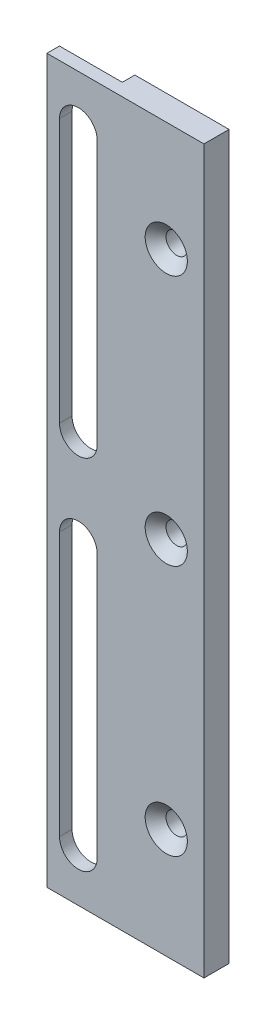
ISO-10303-21;
HEADER;
FILE_DESCRIPTION(('STEP AP214'),'2;1');
FILE_NAME('part.step','',(''),(''),'','','');
FILE_SCHEMA(('AUTOMOTIVE_DESIGN { 1 0 10303 214 1 1 1 1 }'));
ENDSEC;
DATA;
#1=APPLICATION_CONTEXT('core data for automotive mechanical design processes');
#2=APPLICATION_PROTOCOL_DEFINITION('international standard','automotive_design',2000,#1);
#3=PRODUCT_CONTEXT('',#1,'mechanical');
#4=PRODUCT('Part','Part','',(#3));
#5=PRODUCT_RELATED_PRODUCT_CATEGORY('part','',(#4));
#6=PRODUCT_DEFINITION_FORMATION('','',#4);
#7=PRODUCT_DEFINITION_CONTEXT('part definition',#1,'design');
#8=PRODUCT_DEFINITION('design','',#6,#7);
#9=PRODUCT_DEFINITION_SHAPE('','',#8);
#10=(LENGTH_UNIT() NAMED_UNIT(*) SI_UNIT(.MILLI.,.METRE.));
#11=(NAMED_UNIT(*) PLANE_ANGLE_UNIT() SI_UNIT($,.RADIAN.));
#12=(NAMED_UNIT(*) SI_UNIT($,.STERADIAN.) SOLID_ANGLE_UNIT());
#13=UNCERTAINTY_MEASURE_WITH_UNIT(LENGTH_MEASURE(1.E-05),#10,'distance_accuracy_value','');
#14=(GEOMETRIC_REPRESENTATION_CONTEXT(3) GLOBAL_UNCERTAINTY_ASSIGNED_CONTEXT((#13)) GLOBAL_UNIT_ASSIGNED_CONTEXT((#10,
#11,#12)) REPRESENTATION_CONTEXT('',''));
#15=CARTESIAN_POINT('',(0.,0.,0.));
#16=DIRECTION('',(0.,0.,1.));
#17=DIRECTION('',(1.,0.,0.));
#18=AXIS2_PLACEMENT_3D('',#15,#16,#17);
#19=CARTESIAN_POINT('',(25.,0.,0.));
#20=DIRECTION('',(0.,0.,-1.));
#21=DIRECTION('',(-1.,0.,0.));
#22=AXIS2_PLACEMENT_3D('',#19,#20,#21);
#23=PLANE('',#22);
#24=CARTESIAN_POINT('',(19.,97.5,0.));
#25=DIRECTION('',(0.,0.,1.));
#26=DIRECTION('',(1.,0.,0.));
#27=AXIS2_PLACEMENT_3D('',#24,#25,#26);
#28=CIRCLE('',#27,3.36);
#29=CARTESIAN_POINT('',(22.36,97.5,0.));
#30=VERTEX_POINT('',#29);
#31=EDGE_CURVE('E284',#30,#30,#28,.T.);
#32=ORIENTED_EDGE('',*,*,#31,.F.);
#33=EDGE_LOOP('',(#32));
#34=FACE_BOUND('',#33,.T.);
#35=CARTESIAN_POINT('',(19.,57.5,0.));
#36=DIRECTION('',(0.,0.,1.));
#37=DIRECTION('',(1.,0.,0.));
#38=AXIS2_PLACEMENT_3D('',#35,#36,#37);
#39=CIRCLE('',#38,3.36);
#40=CARTESIAN_POINT('',(22.36,57.5,0.));
#41=VERTEX_POINT('',#40);
#42=EDGE_CURVE('E288',#41,#41,#39,.T.);
#43=ORIENTED_EDGE('',*,*,#42,.F.);
#44=EDGE_LOOP('',(#43));
#45=FACE_BOUND('',#44,.T.);
#46=CARTESIAN_POINT('',(19.,17.5,0.));
#47=DIRECTION('',(0.,0.,1.));
#48=DIRECTION('',(1.,0.,0.));
#49=AXIS2_PLACEMENT_3D('',#46,#47,#48);
#50=CIRCLE('',#49,3.36);
#51=CARTESIAN_POINT('',(22.36,17.5,0.));
#52=VERTEX_POINT('',#51);
#53=EDGE_CURVE('E292',#52,#52,#50,.T.);
#54=ORIENTED_EDGE('',*,*,#53,.F.);
#55=EDGE_LOOP('',(#54));
#56=FACE_BOUND('',#55,.T.);
#57=DIRECTION('',(0.,1.,0.));
#58=VECTOR('',#57,1.);
#59=CARTESIAN_POINT('',(2.,50.,0.));
#60=LINE('',#59,#58);
#61=CARTESIAN_POINT('',(2.,8.,0.));
#62=VERTEX_POINT('',#61);
#63=CARTESIAN_POINT('',(2.,50.,0.));
#64=VERTEX_POINT('',#63);
#65=EDGE_CURVE('E188',#62,#64,#60,.T.);
#66=ORIENTED_EDGE('',*,*,#65,.T.);
#67=CARTESIAN_POINT('',(5.,50.,0.));
#68=DIRECTION('',(0.,0.,-1.));
#69=DIRECTION('',(-1.,0.,0.));
#70=AXIS2_PLACEMENT_3D('',#67,#68,#69);
#71=CIRCLE('',#70,3.);
#72=CARTESIAN_POINT('',(8.,50.,0.));
#73=VERTEX_POINT('',#72);
#74=EDGE_CURVE('E179',#64,#73,#71,.T.);
#75=ORIENTED_EDGE('',*,*,#74,.T.);
#76=DIRECTION('',(0.,-1.,0.));
#77=VECTOR('',#76,1.);
#78=CARTESIAN_POINT('',(8.,50.,0.));
#79=LINE('',#78,#77);
#80=CARTESIAN_POINT('',(8.,8.,0.));
#81=VERTEX_POINT('',#80);
#82=EDGE_CURVE('E182',#73,#81,#79,.T.);
#83=ORIENTED_EDGE('',*,*,#82,.T.);
#84=CARTESIAN_POINT('',(5.,8.,0.));
#85=DIRECTION('',(0.,0.,-1.));
#86=DIRECTION('',(-1.,0.,0.));
#87=AXIS2_PLACEMENT_3D('',#84,#85,#86);
#88=CIRCLE('',#87,3.);
#89=EDGE_CURVE('E185',#81,#62,#88,.T.);
#90=ORIENTED_EDGE('',*,*,#89,.T.);
#91=EDGE_LOOP('',(#66,#75,#83,#90));
#92=FACE_BOUND('',#91,.T.);
#93=DIRECTION('',(0.,1.,0.));
#94=VECTOR('',#93,1.);
#95=CARTESIAN_POINT('',(2.00000000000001,107.,0.));
#96=LINE('',#95,#94);
#97=CARTESIAN_POINT('',(2.,65.,0.));
#98=VERTEX_POINT('',#97);
#99=CARTESIAN_POINT('',(2.00000000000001,107.,0.));
#100=VERTEX_POINT('',#99);
#101=EDGE_CURVE('E212',#98,#100,#96,.T.);
#102=ORIENTED_EDGE('',*,*,#101,.T.);
#103=CARTESIAN_POINT('',(5.00000000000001,107.,0.));
#104=DIRECTION('',(0.,0.,-1.));
#105=DIRECTION('',(-1.,0.,0.));
#106=AXIS2_PLACEMENT_3D('',#103,#104,#105);
#107=CIRCLE('',#106,3.);
#108=CARTESIAN_POINT('',(8.00000000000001,107.,0.));
#109=VERTEX_POINT('',#108);
#110=EDGE_CURVE('E195',#100,#109,#107,.T.);
#111=ORIENTED_EDGE('',*,*,#110,.T.);
#112=DIRECTION('',(0.,-1.,0.));
#113=VECTOR('',#112,1.);
#114=CARTESIAN_POINT('',(8.00000000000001,107.,0.));
#115=LINE('',#114,#113);
#116=CARTESIAN_POINT('',(8.,65.,0.));
#117=VERTEX_POINT('',#116);
#118=EDGE_CURVE('E206',#109,#117,#115,.T.);
#119=ORIENTED_EDGE('',*,*,#118,.T.);
#120=CARTESIAN_POINT('',(5.,65.,0.));
#121=DIRECTION('',(0.,0.,-1.));
#122=DIRECTION('',(-1.,0.,0.));
#123=AXIS2_PLACEMENT_3D('',#120,#121,#122);
#124=CIRCLE('',#123,3.);
#125=EDGE_CURVE('E209',#117,#98,#124,.T.);
#126=ORIENTED_EDGE('',*,*,#125,.T.);
#127=EDGE_LOOP('',(#102,#111,#119,#126));
#128=FACE_BOUND('',#127,.T.);
#129=DIRECTION('',(0.,-1.,0.));
#130=VECTOR('',#129,1.);
#131=CARTESIAN_POINT('',(0.,0.,0.));
#132=LINE('',#131,#130);
#133=CARTESIAN_POINT('',(0.,115.,0.));
#134=VERTEX_POINT('',#133);
#135=CARTESIAN_POINT('',(0.,0.,0.));
#136=VERTEX_POINT('',#135);
#137=EDGE_CURVE('E219',#134,#136,#132,.T.);
#138=ORIENTED_EDGE('',*,*,#137,.T.);
#139=DIRECTION('',(-1.,0.,0.));
#140=VECTOR('',#139,1.);
#141=CARTESIAN_POINT('',(25.,0.,0.));
#142=LINE('',#141,#140);
#143=CARTESIAN_POINT('',(25.,0.,0.));
#144=VERTEX_POINT('',#143);
#145=EDGE_CURVE('E39',#144,#136,#142,.T.);
#146=ORIENTED_EDGE('',*,*,#145,.F.);
#147=DIRECTION('',(0.,-1.,0.));
#148=VECTOR('',#147,1.);
#149=CARTESIAN_POINT('',(25.,0.,0.));
#150=LINE('',#149,#148);
#151=CARTESIAN_POINT('',(25.,115.,0.));
#152=VERTEX_POINT('',#151);
#153=EDGE_CURVE('E228',#152,#144,#150,.T.);
#154=ORIENTED_EDGE('',*,*,#153,.F.);
#155=DIRECTION('',(-1.,0.,0.));
#156=VECTOR('',#155,1.);
#157=CARTESIAN_POINT('',(25.,115.,0.));
#158=LINE('',#157,#156);
#159=EDGE_CURVE('E238',#152,#134,#158,.T.);
#160=ORIENTED_EDGE('',*,*,#159,.T.);
#161=EDGE_LOOP('',(#138,#146,#154,#160));
#162=FACE_BOUND('',#161,.T.);
#163=ADVANCED_FACE('F32',(#34,#45,#56,#92,#128,#162),#23,.F.);
#164=CARTESIAN_POINT('',(25.,0.,0.));
#165=DIRECTION('',(0.,1.,0.));
#166=DIRECTION('',(0.,0.,1.));
#167=AXIS2_PLACEMENT_3D('',#164,#165,#166);
#168=PLANE('',#167);
#169=DIRECTION('',(-1.,0.,0.));
#170=VECTOR('',#169,1.);
#171=CARTESIAN_POINT('',(10.,0.,-2.));
#172=LINE('',#171,#170);
#173=CARTESIAN_POINT('',(10.,0.,-2.));
#174=VERTEX_POINT('',#173);
#175=CARTESIAN_POINT('',(0.,0.,-2.));
#176=VERTEX_POINT('',#175);
#177=EDGE_CURVE('E46',#174,#176,#172,.T.);
#178=ORIENTED_EDGE('',*,*,#177,.F.);
#179=DIRECTION('',(0.,0.,-1.));
#180=VECTOR('',#179,1.);
#181=CARTESIAN_POINT('',(10.,0.,-2.));
#182=LINE('',#181,#180);
#183=CARTESIAN_POINT('',(10.,0.,-4.));
#184=VERTEX_POINT('',#183);
#185=EDGE_CURVE('E132',#174,#184,#182,.T.);
#186=ORIENTED_EDGE('',*,*,#185,.T.);
#187=DIRECTION('',(-1.,0.,0.));
#188=VECTOR('',#187,1.);
#189=CARTESIAN_POINT('',(25.,0.,-4.));
#190=LINE('',#189,#188);
#191=CARTESIAN_POINT('',(25.,0.,-4.));
#192=VERTEX_POINT('',#191);
#193=EDGE_CURVE('E248',#192,#184,#190,.T.);
#194=ORIENTED_EDGE('',*,*,#193,.F.);
#195=DIRECTION('',(0.,0.,-1.));
#196=VECTOR('',#195,1.);
#197=CARTESIAN_POINT('',(25.,0.,0.));
#198=LINE('',#197,#196);
#199=EDGE_CURVE('E231',#144,#192,#198,.T.);
#200=ORIENTED_EDGE('',*,*,#199,.F.);
#201=ORIENTED_EDGE('',*,*,#145,.T.);
#202=DIRECTION('',(0.,0.,-1.));
#203=VECTOR('',#202,1.);
#204=CARTESIAN_POINT('',(0.,0.,0.));
#205=LINE('',#204,#203);
#206=EDGE_CURVE('E151',#136,#176,#205,.T.);
#207=ORIENTED_EDGE('',*,*,#206,.T.);
#208=EDGE_LOOP('',(#178,#186,#194,#200,#201,#207));
#209=FACE_BOUND('',#208,.T.);
#210=ADVANCED_FACE('F149',(#209),#168,.F.);
#211=CARTESIAN_POINT('',(25.,0.,-4.));
#212=DIRECTION('',(0.,0.,1.));
#213=DIRECTION('',(1.,0.,0.));
#214=AXIS2_PLACEMENT_3D('',#211,#212,#213);
#215=PLANE('',#214);
#216=CARTESIAN_POINT('',(19.,97.5,-4.));
#217=DIRECTION('',(0.,0.,1.));
#218=DIRECTION('',(1.,0.,0.));
#219=AXIS2_PLACEMENT_3D('',#216,#217,#218);
#220=CIRCLE('',#219,1.7);
#221=CARTESIAN_POINT('',(20.7,97.5,-4.));
#222=VERTEX_POINT('',#221);
#223=EDGE_CURVE('E474',#222,#222,#220,.T.);
#224=ORIENTED_EDGE('',*,*,#223,.T.);
#225=EDGE_LOOP('',(#224));
#226=FACE_BOUND('',#225,.T.);
#227=CARTESIAN_POINT('',(19.,57.5,-4.));
#228=DIRECTION('',(0.,0.,1.));
#229=DIRECTION('',(1.,0.,0.));
#230=AXIS2_PLACEMENT_3D('',#227,#228,#229);
#231=CIRCLE('',#230,1.7);
#232=CARTESIAN_POINT('',(20.7,57.5,-4.));
#233=VERTEX_POINT('',#232);
#234=EDGE_CURVE('E483',#233,#233,#231,.T.);
#235=ORIENTED_EDGE('',*,*,#234,.T.);
#236=EDGE_LOOP('',(#235));
#237=FACE_BOUND('',#236,.T.);
#238=CARTESIAN_POINT('',(19.,17.5,-4.));
#239=DIRECTION('',(0.,0.,1.));
#240=DIRECTION('',(1.,0.,0.));
#241=AXIS2_PLACEMENT_3D('',#238,#239,#240);
#242=CIRCLE('',#241,1.7);
#243=CARTESIAN_POINT('',(20.7,17.5,-4.));
#244=VERTEX_POINT('',#243);
#245=EDGE_CURVE('E159',#244,#244,#242,.T.);
#246=ORIENTED_EDGE('',*,*,#245,.T.);
#247=EDGE_LOOP('',(#246));
#248=FACE_BOUND('',#247,.T.);
#249=ORIENTED_EDGE('',*,*,#193,.T.);
#250=DIRECTION('',(0.,-1.,0.));
#251=VECTOR('',#250,1.);
#252=CARTESIAN_POINT('',(10.,0.,-4.));
#253=LINE('',#252,#251);
#254=CARTESIAN_POINT('',(10.,115.,-4.));
#255=VERTEX_POINT('',#254);
#256=EDGE_CURVE('E137',#255,#184,#253,.T.);
#257=ORIENTED_EDGE('',*,*,#256,.F.);
#258=DIRECTION('',(-1.,0.,0.));
#259=VECTOR('',#258,1.);
#260=CARTESIAN_POINT('',(25.,115.,-4.));
#261=LINE('',#260,#259);
#262=CARTESIAN_POINT('',(25.,115.,-4.));
#263=VERTEX_POINT('',#262);
#264=EDGE_CURVE('E245',#263,#255,#261,.T.);
#265=ORIENTED_EDGE('',*,*,#264,.F.);
#266=DIRECTION('',(0.,1.,0.));
#267=VECTOR('',#266,1.);
#268=CARTESIAN_POINT('',(25.,0.,-4.));
#269=LINE('',#268,#267);
#270=EDGE_CURVE('E234',#192,#263,#269,.T.);
#271=ORIENTED_EDGE('',*,*,#270,.F.);
#272=EDGE_LOOP('',(#249,#257,#265,#271));
#273=FACE_BOUND('',#272,.T.);
#274=ADVANCED_FACE('F262',(#226,#237,#248,#273),#215,.F.);
#275=CARTESIAN_POINT('',(25.,115.,0.));
#276=DIRECTION('',(0.,-1.,0.));
#277=DIRECTION('',(0.,0.,-1.));
#278=AXIS2_PLACEMENT_3D('',#275,#276,#277);
#279=PLANE('',#278);
#280=ORIENTED_EDGE('',*,*,#264,.T.);
#281=DIRECTION('',(0.,0.,-1.));
#282=VECTOR('',#281,1.);
#283=CARTESIAN_POINT('',(10.,115.,-2.));
#284=LINE('',#283,#282);
#285=CARTESIAN_POINT('',(10.,115.,-2.));
#286=VERTEX_POINT('',#285);
#287=EDGE_CURVE('E141',#286,#255,#284,.T.);
#288=ORIENTED_EDGE('',*,*,#287,.F.);
#289=DIRECTION('',(1.,0.,0.));
#290=VECTOR('',#289,1.);
#291=CARTESIAN_POINT('',(10.,115.,-2.));
#292=LINE('',#291,#290);
#293=CARTESIAN_POINT('',(0.,115.,-2.));
#294=VERTEX_POINT('',#293);
#295=EDGE_CURVE('E142',#294,#286,#292,.T.);
#296=ORIENTED_EDGE('',*,*,#295,.F.);
#297=DIRECTION('',(0.,0.,1.));
#298=VECTOR('',#297,1.);
#299=CARTESIAN_POINT('',(0.,115.,0.));
#300=LINE('',#299,#298);
#301=EDGE_CURVE('E232',#294,#134,#300,.T.);
#302=ORIENTED_EDGE('',*,*,#301,.T.);
#303=ORIENTED_EDGE('',*,*,#159,.F.);
#304=DIRECTION('',(0.,0.,1.));
#305=VECTOR('',#304,1.);
#306=CARTESIAN_POINT('',(25.,115.,0.));
#307=LINE('',#306,#305);
#308=EDGE_CURVE('E236',#263,#152,#307,.T.);
#309=ORIENTED_EDGE('',*,*,#308,.F.);
#310=EDGE_LOOP('',(#280,#288,#296,#302,#303,#309));
#311=FACE_BOUND('',#310,.T.);
#312=ADVANCED_FACE('F258',(#311),#279,.F.);
#313=CARTESIAN_POINT('',(25.,0.,0.));
#314=DIRECTION('',(-1.,0.,0.));
#315=DIRECTION('',(0.,0.,1.));
#316=AXIS2_PLACEMENT_3D('',#313,#314,#315);
#317=PLANE('',#316);
#318=ORIENTED_EDGE('',*,*,#153,.T.);
#319=ORIENTED_EDGE('',*,*,#199,.T.);
#320=ORIENTED_EDGE('',*,*,#270,.T.);
#321=ORIENTED_EDGE('',*,*,#308,.T.);
#322=EDGE_LOOP('',(#318,#319,#320,#321));
#323=FACE_BOUND('',#322,.T.);
#324=ADVANCED_FACE('F265',(#323),#317,.F.);
#325=CARTESIAN_POINT('',(0.,0.,0.));
#326=DIRECTION('',(-1.,0.,0.));
#327=DIRECTION('',(0.,0.,1.));
#328=AXIS2_PLACEMENT_3D('',#325,#326,#327);
#329=PLANE('',#328);
#330=DIRECTION('',(0.,1.,0.));
#331=VECTOR('',#330,1.);
#332=CARTESIAN_POINT('',(0.,0.,-2.));
#333=LINE('',#332,#331);
#334=EDGE_CURVE('E152',#176,#294,#333,.T.);
#335=ORIENTED_EDGE('',*,*,#334,.F.);
#336=ORIENTED_EDGE('',*,*,#206,.F.);
#337=ORIENTED_EDGE('',*,*,#137,.F.);
#338=ORIENTED_EDGE('',*,*,#301,.F.);
#339=EDGE_LOOP('',(#335,#336,#337,#338));
#340=FACE_BOUND('',#339,.T.);
#341=ADVANCED_FACE('F256',(#340),#329,.T.);
#342=CARTESIAN_POINT('',(5.00000000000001,107.,0.));
#343=DIRECTION('',(0.,0.,-1.));
#344=DIRECTION('',(-1.,0.,0.));
#345=AXIS2_PLACEMENT_3D('',#342,#343,#344);
#346=CYLINDRICAL_SURFACE('',#345,3.);
#347=DIRECTION('',(0.,0.,-1.));
#348=VECTOR('',#347,1.);
#349=CARTESIAN_POINT('',(2.00000000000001,107.,0.));
#350=LINE('',#349,#348);
#351=CARTESIAN_POINT('',(2.00000000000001,107.,-2.));
#352=VERTEX_POINT('',#351);
#353=EDGE_CURVE('E216',#100,#352,#350,.T.);
#354=ORIENTED_EDGE('',*,*,#353,.T.);
#355=CARTESIAN_POINT('',(5.00000000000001,107.,-2.));
#356=DIRECTION('',(0.,0.,1.));
#357=DIRECTION('',(1.,0.,0.));
#358=AXIS2_PLACEMENT_3D('',#355,#356,#357);
#359=CIRCLE('',#358,3.);
#360=CARTESIAN_POINT('',(8.00000000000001,107.,-2.));
#361=VERTEX_POINT('',#360);
#362=EDGE_CURVE('E176',#352,#361,#359,.F.);
#363=ORIENTED_EDGE('',*,*,#362,.T.);
#364=DIRECTION('',(0.,0.,-1.));
#365=VECTOR('',#364,1.);
#366=CARTESIAN_POINT('',(8.00000000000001,107.,0.));
#367=LINE('',#366,#365);
#368=EDGE_CURVE('E215',#109,#361,#367,.T.);
#369=ORIENTED_EDGE('',*,*,#368,.F.);
#370=ORIENTED_EDGE('',*,*,#110,.F.);
#371=EDGE_LOOP('',(#354,#363,#369,#370));
#372=FACE_BOUND('',#371,.T.);
#373=ADVANCED_FACE('F272',(#372),#346,.F.);
#374=CARTESIAN_POINT('',(2.00000000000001,107.,0.));
#375=DIRECTION('',(-1.,0.,0.));
#376=DIRECTION('',(0.,-1.,0.));
#377=AXIS2_PLACEMENT_3D('',#374,#375,#376);
#378=PLANE('',#377);
#379=DIRECTION('',(0.,0.,-1.));
#380=VECTOR('',#379,1.);
#381=CARTESIAN_POINT('',(2.,65.,0.));
#382=LINE('',#381,#380);
#383=CARTESIAN_POINT('',(2.,65.,-2.));
#384=VERTEX_POINT('',#383);
#385=EDGE_CURVE('E220',#98,#384,#382,.T.);
#386=ORIENTED_EDGE('',*,*,#385,.T.);
#387=DIRECTION('',(0.,1.,0.));
#388=VECTOR('',#387,1.);
#389=CARTESIAN_POINT('',(2.00000000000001,107.,-2.));
#390=LINE('',#389,#388);
#391=EDGE_CURVE('E173',#384,#352,#390,.T.);
#392=ORIENTED_EDGE('',*,*,#391,.T.);
#393=ORIENTED_EDGE('',*,*,#353,.F.);
#394=ORIENTED_EDGE('',*,*,#101,.F.);
#395=EDGE_LOOP('',(#386,#392,#393,#394));
#396=FACE_BOUND('',#395,.T.);
#397=ADVANCED_FACE('F298',(#396),#378,.F.);
#398=CARTESIAN_POINT('',(5.,65.,0.));
#399=DIRECTION('',(0.,0.,-1.));
#400=DIRECTION('',(-1.,0.,0.));
#401=AXIS2_PLACEMENT_3D('',#398,#399,#400);
#402=CYLINDRICAL_SURFACE('',#401,3.);
#403=DIRECTION('',(0.,0.,-1.));
#404=VECTOR('',#403,1.);
#405=CARTESIAN_POINT('',(8.,65.,0.));
#406=LINE('',#405,#404);
#407=CARTESIAN_POINT('',(8.,65.,-2.));
#408=VERTEX_POINT('',#407);
#409=EDGE_CURVE('E223',#117,#408,#406,.T.);
#410=ORIENTED_EDGE('',*,*,#409,.T.);
#411=CARTESIAN_POINT('',(5.,65.,-2.));
#412=DIRECTION('',(0.,0.,1.));
#413=DIRECTION('',(1.,0.,0.));
#414=AXIS2_PLACEMENT_3D('',#411,#412,#413);
#415=CIRCLE('',#414,3.);
#416=EDGE_CURVE('E54',#408,#384,#415,.F.);
#417=ORIENTED_EDGE('',*,*,#416,.T.);
#418=ORIENTED_EDGE('',*,*,#385,.F.);
#419=ORIENTED_EDGE('',*,*,#125,.F.);
#420=EDGE_LOOP('',(#410,#417,#418,#419));
#421=FACE_BOUND('',#420,.T.);
#422=ADVANCED_FACE('F305',(#421),#402,.F.);
#423=CARTESIAN_POINT('',(8.00000000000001,107.,0.));
#424=DIRECTION('',(1.,0.,0.));
#425=DIRECTION('',(0.,1.,0.));
#426=AXIS2_PLACEMENT_3D('',#423,#424,#425);
#427=PLANE('',#426);
#428=ORIENTED_EDGE('',*,*,#368,.T.);
#429=DIRECTION('',(0.,-1.,0.));
#430=VECTOR('',#429,1.);
#431=CARTESIAN_POINT('',(8.00000000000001,107.,-2.));
#432=LINE('',#431,#430);
#433=EDGE_CURVE('E170',#361,#408,#432,.T.);
#434=ORIENTED_EDGE('',*,*,#433,.T.);
#435=ORIENTED_EDGE('',*,*,#409,.F.);
#436=ORIENTED_EDGE('',*,*,#118,.F.);
#437=EDGE_LOOP('',(#428,#434,#435,#436));
#438=FACE_BOUND('',#437,.T.);
#439=ADVANCED_FACE('F303',(#438),#427,.F.);
#440=CARTESIAN_POINT('',(5.,50.,0.));
#441=DIRECTION('',(0.,0.,-1.));
#442=DIRECTION('',(-1.,0.,0.));
#443=AXIS2_PLACEMENT_3D('',#440,#441,#442);
#444=CYLINDRICAL_SURFACE('',#443,3.);
#445=DIRECTION('',(0.,0.,-1.));
#446=VECTOR('',#445,1.);
#447=CARTESIAN_POINT('',(2.,50.,0.));
#448=LINE('',#447,#446);
#449=CARTESIAN_POINT('',(2.,50.,-2.));
#450=VERTEX_POINT('',#449);
#451=EDGE_CURVE('E192',#64,#450,#448,.T.);
#452=ORIENTED_EDGE('',*,*,#451,.T.);
#453=CARTESIAN_POINT('',(5.,50.,-2.));
#454=DIRECTION('',(0.,0.,1.));
#455=DIRECTION('',(1.,0.,0.));
#456=AXIS2_PLACEMENT_3D('',#453,#454,#455);
#457=CIRCLE('',#456,3.);
#458=CARTESIAN_POINT('',(8.,50.,-2.));
#459=VERTEX_POINT('',#458);
#460=EDGE_CURVE('E167',#450,#459,#457,.F.);
#461=ORIENTED_EDGE('',*,*,#460,.T.);
#462=DIRECTION('',(0.,0.,-1.));
#463=VECTOR('',#462,1.);
#464=CARTESIAN_POINT('',(8.,50.,0.));
#465=LINE('',#464,#463);
#466=EDGE_CURVE('E191',#73,#459,#465,.T.);
#467=ORIENTED_EDGE('',*,*,#466,.F.);
#468=ORIENTED_EDGE('',*,*,#74,.F.);
#469=EDGE_LOOP('',(#452,#461,#467,#468));
#470=FACE_BOUND('',#469,.T.);
#471=ADVANCED_FACE('F312',(#470),#444,.F.);
#472=CARTESIAN_POINT('',(2.,50.,0.));
#473=DIRECTION('',(-1.,0.,0.));
#474=DIRECTION('',(0.,-1.,0.));
#475=AXIS2_PLACEMENT_3D('',#472,#473,#474);
#476=PLANE('',#475);
#477=DIRECTION('',(0.,0.,-1.));
#478=VECTOR('',#477,1.);
#479=CARTESIAN_POINT('',(2.,8.,0.));
#480=LINE('',#479,#478);
#481=CARTESIAN_POINT('',(2.,8.,-2.));
#482=VERTEX_POINT('',#481);
#483=EDGE_CURVE('E196',#62,#482,#480,.T.);
#484=ORIENTED_EDGE('',*,*,#483,.T.);
#485=DIRECTION('',(0.,1.,0.));
#486=VECTOR('',#485,1.);
#487=CARTESIAN_POINT('',(2.,50.,-2.));
#488=LINE('',#487,#486);
#489=EDGE_CURVE('E164',#482,#450,#488,.T.);
#490=ORIENTED_EDGE('',*,*,#489,.T.);
#491=ORIENTED_EDGE('',*,*,#451,.F.);
#492=ORIENTED_EDGE('',*,*,#65,.F.);
#493=EDGE_LOOP('',(#484,#490,#491,#492));
#494=FACE_BOUND('',#493,.T.);
#495=ADVANCED_FACE('F344',(#494),#476,.F.);
#496=CARTESIAN_POINT('',(5.,8.,0.));
#497=DIRECTION('',(0.,0.,-1.));
#498=DIRECTION('',(-1.,0.,0.));
#499=AXIS2_PLACEMENT_3D('',#496,#497,#498);
#500=CYLINDRICAL_SURFACE('',#499,3.);
#501=DIRECTION('',(0.,0.,-1.));
#502=VECTOR('',#501,1.);
#503=CARTESIAN_POINT('',(8.,8.,0.));
#504=LINE('',#503,#502);
#505=CARTESIAN_POINT('',(8.,8.,-2.));
#506=VERTEX_POINT('',#505);
#507=EDGE_CURVE('E199',#81,#506,#504,.T.);
#508=ORIENTED_EDGE('',*,*,#507,.T.);
#509=CARTESIAN_POINT('',(5.,8.,-2.));
#510=DIRECTION('',(0.,0.,1.));
#511=DIRECTION('',(1.,0.,0.));
#512=AXIS2_PLACEMENT_3D('',#509,#510,#511);
#513=CIRCLE('',#512,3.);
#514=EDGE_CURVE('E160',#506,#482,#513,.F.);
#515=ORIENTED_EDGE('',*,*,#514,.T.);
#516=ORIENTED_EDGE('',*,*,#483,.F.);
#517=ORIENTED_EDGE('',*,*,#89,.F.);
#518=EDGE_LOOP('',(#508,#515,#516,#517));
#519=FACE_BOUND('',#518,.T.);
#520=ADVANCED_FACE('F353',(#519),#500,.F.);
#521=CARTESIAN_POINT('',(8.,50.,0.));
#522=DIRECTION('',(1.,0.,0.));
#523=DIRECTION('',(0.,1.,0.));
#524=AXIS2_PLACEMENT_3D('',#521,#522,#523);
#525=PLANE('',#524);
#526=ORIENTED_EDGE('',*,*,#466,.T.);
#527=DIRECTION('',(0.,-1.,0.));
#528=VECTOR('',#527,1.);
#529=CARTESIAN_POINT('',(8.,50.,-2.));
#530=LINE('',#529,#528);
#531=EDGE_CURVE('E11',#459,#506,#530,.T.);
#532=ORIENTED_EDGE('',*,*,#531,.T.);
#533=ORIENTED_EDGE('',*,*,#507,.F.);
#534=ORIENTED_EDGE('',*,*,#82,.F.);
#535=EDGE_LOOP('',(#526,#532,#533,#534));
#536=FACE_BOUND('',#535,.T.);
#537=ADVANCED_FACE('F363',(#536),#525,.F.);
#538=CARTESIAN_POINT('',(0.,0.,-2.));
#539=DIRECTION('',(0.,0.,1.));
#540=DIRECTION('',(1.,0.,0.));
#541=AXIS2_PLACEMENT_3D('',#538,#539,#540);
#542=PLANE('',#541);
#543=ORIENTED_EDGE('',*,*,#489,.F.);
#544=ORIENTED_EDGE('',*,*,#514,.F.);
#545=ORIENTED_EDGE('',*,*,#531,.F.);
#546=ORIENTED_EDGE('',*,*,#460,.F.);
#547=EDGE_LOOP('',(#543,#544,#545,#546));
#548=FACE_BOUND('',#547,.T.);
#549=DIRECTION('',(0.,-1.,0.));
#550=VECTOR('',#549,1.);
#551=CARTESIAN_POINT('',(10.,0.,-2.));
#552=LINE('',#551,#550);
#553=EDGE_CURVE('E134',#286,#174,#552,.T.);
#554=ORIENTED_EDGE('',*,*,#553,.T.);
#555=ORIENTED_EDGE('',*,*,#177,.T.);
#556=ORIENTED_EDGE('',*,*,#334,.T.);
#557=ORIENTED_EDGE('',*,*,#295,.T.);
#558=EDGE_LOOP('',(#554,#555,#556,#557));
#559=FACE_BOUND('',#558,.T.);
#560=ORIENTED_EDGE('',*,*,#391,.F.);
#561=ORIENTED_EDGE('',*,*,#416,.F.);
#562=ORIENTED_EDGE('',*,*,#433,.F.);
#563=ORIENTED_EDGE('',*,*,#362,.F.);
#564=EDGE_LOOP('',(#560,#561,#562,#563));
#565=FACE_BOUND('',#564,.T.);
#566=ADVANCED_FACE('F144',(#548,#559,#565),#542,.F.);
#567=CARTESIAN_POINT('',(10.,0.,-2.));
#568=DIRECTION('',(1.,0.,0.));
#569=DIRECTION('',(0.,0.,-1.));
#570=AXIS2_PLACEMENT_3D('',#567,#568,#569);
#571=PLANE('',#570);
#572=ORIENTED_EDGE('',*,*,#256,.T.);
#573=ORIENTED_EDGE('',*,*,#185,.F.);
#574=ORIENTED_EDGE('',*,*,#553,.F.);
#575=ORIENTED_EDGE('',*,*,#287,.T.);
#576=EDGE_LOOP('',(#572,#573,#574,#575));
#577=FACE_BOUND('',#576,.T.);
#578=ADVANCED_FACE('F133',(#577),#571,.F.);
#579=CARTESIAN_POINT('',(19.,17.5,0.));
#580=DIRECTION('',(0.,0.,1.));
#581=DIRECTION('',(1.,0.,0.));
#582=AXIS2_PLACEMENT_3D('',#579,#580,#581);
#583=CYLINDRICAL_SURFACE('',#582,1.7);
#584=ORIENTED_EDGE('',*,*,#245,.F.);
#585=EDGE_LOOP('',(#584));
#586=FACE_BOUND('',#585,.T.);
#587=CARTESIAN_POINT('',(19.,17.5,-1.66));
#588=DIRECTION('',(0.,0.,1.));
#589=DIRECTION('',(1.,0.,0.));
#590=AXIS2_PLACEMENT_3D('',#587,#588,#589);
#591=CIRCLE('',#590,1.7);
#592=CARTESIAN_POINT('',(20.7,17.5,-1.66));
#593=VERTEX_POINT('',#592);
#594=EDGE_CURVE('E487',#593,#593,#591,.T.);
#595=ORIENTED_EDGE('',*,*,#594,.T.);
#596=EDGE_LOOP('',(#595));
#597=FACE_BOUND('',#596,.T.);
#598=ADVANCED_FACE('F390',(#586,#597),#583,.F.);
#599=CARTESIAN_POINT('',(19.,17.5,0.));
#600=DIRECTION('',(0.,0.,1.));
#601=DIRECTION('',(1.,0.,0.));
#602=AXIS2_PLACEMENT_3D('',#599,#600,#601);
#603=CONICAL_SURFACE('',#602,3.36,0.785398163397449);
#604=ORIENTED_EDGE('',*,*,#594,.F.);
#605=EDGE_LOOP('',(#604));
#606=FACE_BOUND('',#605,.T.);
#607=ORIENTED_EDGE('',*,*,#53,.T.);
#608=EDGE_LOOP('',(#607));
#609=FACE_BOUND('',#608,.T.);
#610=ADVANCED_FACE('F415',(#606,#609),#603,.F.);
#611=CARTESIAN_POINT('',(19.,57.5,0.));
#612=DIRECTION('',(0.,0.,1.));
#613=DIRECTION('',(1.,0.,0.));
#614=AXIS2_PLACEMENT_3D('',#611,#612,#613);
#615=CYLINDRICAL_SURFACE('',#614,1.7);
#616=ORIENTED_EDGE('',*,*,#234,.F.);
#617=EDGE_LOOP('',(#616));
#618=FACE_BOUND('',#617,.T.);
#619=CARTESIAN_POINT('',(19.,57.5,-1.66));
#620=DIRECTION('',(0.,0.,1.));
#621=DIRECTION('',(1.,0.,0.));
#622=AXIS2_PLACEMENT_3D('',#619,#620,#621);
#623=CIRCLE('',#622,1.7);
#624=CARTESIAN_POINT('',(20.7,57.5,-1.66));
#625=VERTEX_POINT('',#624);
#626=EDGE_CURVE('E480',#625,#625,#623,.T.);
#627=ORIENTED_EDGE('',*,*,#626,.T.);
#628=EDGE_LOOP('',(#627));
#629=FACE_BOUND('',#628,.T.);
#630=ADVANCED_FACE('F425',(#618,#629),#615,.F.);
#631=CARTESIAN_POINT('',(19.,57.5,0.));
#632=DIRECTION('',(0.,0.,1.));
#633=DIRECTION('',(1.,0.,0.));
#634=AXIS2_PLACEMENT_3D('',#631,#632,#633);
#635=CONICAL_SURFACE('',#634,3.36,0.785398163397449);
#636=ORIENTED_EDGE('',*,*,#626,.F.);
#637=EDGE_LOOP('',(#636));
#638=FACE_BOUND('',#637,.T.);
#639=ORIENTED_EDGE('',*,*,#42,.T.);
#640=EDGE_LOOP('',(#639));
#641=FACE_BOUND('',#640,.T.);
#642=ADVANCED_FACE('F435',(#638,#641),#635,.F.);
#643=CARTESIAN_POINT('',(19.,97.5,0.));
#644=DIRECTION('',(0.,0.,1.));
#645=DIRECTION('',(1.,0.,0.));
#646=AXIS2_PLACEMENT_3D('',#643,#644,#645);
#647=CYLINDRICAL_SURFACE('',#646,1.7);
#648=ORIENTED_EDGE('',*,*,#223,.F.);
#649=EDGE_LOOP('',(#648));
#650=FACE_BOUND('',#649,.T.);
#651=CARTESIAN_POINT('',(19.,97.5,-1.66));
#652=DIRECTION('',(0.,0.,1.));
#653=DIRECTION('',(1.,0.,0.));
#654=AXIS2_PLACEMENT_3D('',#651,#652,#653);
#655=CIRCLE('',#654,1.7);
#656=CARTESIAN_POINT('',(20.7,97.5,-1.66));
#657=VERTEX_POINT('',#656);
#658=EDGE_CURVE('E472',#657,#657,#655,.T.);
#659=ORIENTED_EDGE('',*,*,#658,.T.);
#660=EDGE_LOOP('',(#659));
#661=FACE_BOUND('',#660,.T.);
#662=ADVANCED_FACE('F445',(#650,#661),#647,.F.);
#663=CARTESIAN_POINT('',(19.,97.5,0.));
#664=DIRECTION('',(0.,0.,1.));
#665=DIRECTION('',(1.,0.,0.));
#666=AXIS2_PLACEMENT_3D('',#663,#664,#665);
#667=CONICAL_SURFACE('',#666,3.36,0.785398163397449);
#668=ORIENTED_EDGE('',*,*,#658,.F.);
#669=EDGE_LOOP('',(#668));
#670=FACE_BOUND('',#669,.T.);
#671=ORIENTED_EDGE('',*,*,#31,.T.);
#672=EDGE_LOOP('',(#671));
#673=FACE_BOUND('',#672,.T.);
#674=ADVANCED_FACE('F455',(#670,#673),#667,.F.);
#675=CLOSED_SHELL('',(#163,#210,#274,#312,#324,#341,#373,#397,#422,#439,#471,#495,#520,#537,
#566,#578,#598,#610,#630,#642,#662,#674));
#676=MANIFOLD_SOLID_BREP('B2',#675);
#677=ADVANCED_BREP_SHAPE_REPRESENTATION('',(#18,#676),#14);
#678=SHAPE_DEFINITION_REPRESENTATION(#9,#677);
ENDSEC;
END-ISO-10303-21;
